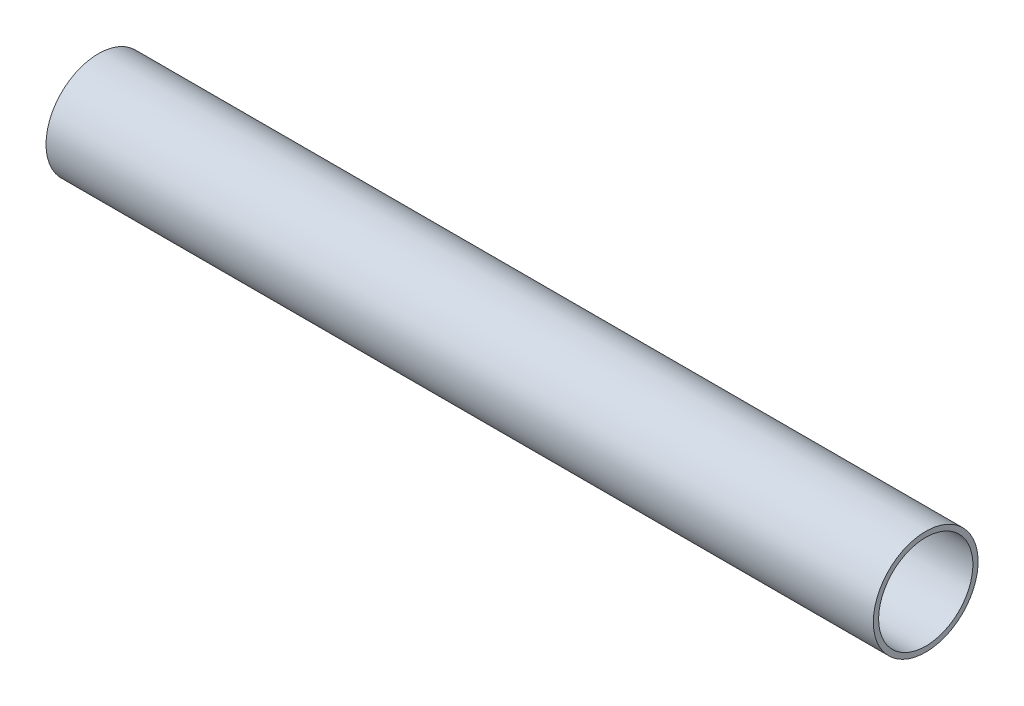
ISO-10303-21;
HEADER;
FILE_DESCRIPTION(('STEP AP214'),'2;1');
FILE_NAME('part.step','',(''),(''),'','','');
FILE_SCHEMA(('AUTOMOTIVE_DESIGN { 1 0 10303 214 1 1 1 1 }'));
ENDSEC;
DATA;
#1=APPLICATION_CONTEXT('core data for automotive mechanical design processes');
#2=APPLICATION_PROTOCOL_DEFINITION('international standard','automotive_design',2000,#1);
#3=PRODUCT_CONTEXT('',#1,'mechanical');
#4=PRODUCT('Part','Part','',(#3));
#5=PRODUCT_RELATED_PRODUCT_CATEGORY('part','',(#4));
#6=PRODUCT_DEFINITION_FORMATION('','',#4);
#7=PRODUCT_DEFINITION_CONTEXT('part definition',#1,'design');
#8=PRODUCT_DEFINITION('design','',#6,#7);
#9=PRODUCT_DEFINITION_SHAPE('','',#8);
#10=(LENGTH_UNIT() NAMED_UNIT(*) SI_UNIT(.MILLI.,.METRE.));
#11=(NAMED_UNIT(*) PLANE_ANGLE_UNIT() SI_UNIT($,.RADIAN.));
#12=(NAMED_UNIT(*) SI_UNIT($,.STERADIAN.) SOLID_ANGLE_UNIT());
#13=UNCERTAINTY_MEASURE_WITH_UNIT(LENGTH_MEASURE(1.E-05),#10,'distance_accuracy_value','');
#14=(GEOMETRIC_REPRESENTATION_CONTEXT(3) GLOBAL_UNCERTAINTY_ASSIGNED_CONTEXT((#13)) GLOBAL_UNIT_ASSIGNED_CONTEXT((#10,
#11,#12)) REPRESENTATION_CONTEXT('',''));
#15=CARTESIAN_POINT('',(0.,0.,0.));
#16=DIRECTION('',(0.,0.,1.));
#17=DIRECTION('',(1.,0.,0.));
#18=AXIS2_PLACEMENT_3D('',#15,#16,#17);
#19=CARTESIAN_POINT('',(0.,90.,0.));
#20=DIRECTION('',(1.,0.,0.));
#21=DIRECTION('',(0.,0.,-1.));
#22=AXIS2_PLACEMENT_3D('',#19,#20,#21);
#23=PLANE('',#22);
#24=CARTESIAN_POINT('',(0.,0.,0.));
#25=DIRECTION('',(-1.,0.,0.));
#26=DIRECTION('',(0.,0.,1.));
#27=AXIS2_PLACEMENT_3D('',#24,#25,#26);
#28=CIRCLE('',#27,90.);
#29=CARTESIAN_POINT('',(0.,0.,90.));
#30=VERTEX_POINT('',#29);
#31=EDGE_CURVE('E45',#30,#30,#28,.T.);
#32=ORIENTED_EDGE('',*,*,#31,.F.);
#33=EDGE_LOOP('',(#32));
#34=FACE_BOUND('',#33,.T.);
#35=CARTESIAN_POINT('',(0.,0.,0.));
#36=DIRECTION('',(-1.,0.,0.));
#37=DIRECTION('',(0.,0.,1.));
#38=AXIS2_PLACEMENT_3D('',#35,#36,#37);
#39=CIRCLE('',#38,100.);
#40=CARTESIAN_POINT('',(0.,0.,100.));
#41=VERTEX_POINT('',#40);
#42=EDGE_CURVE('E10',#41,#41,#39,.T.);
#43=ORIENTED_EDGE('',*,*,#42,.T.);
#44=EDGE_LOOP('',(#43));
#45=FACE_BOUND('',#44,.T.);
#46=ADVANCED_FACE('F31',(#34,#45),#23,.F.);
#47=CARTESIAN_POINT('',(0.,0.,0.));
#48=DIRECTION('',(-1.,0.,0.));
#49=DIRECTION('',(0.,0.,1.));
#50=AXIS2_PLACEMENT_3D('',#47,#48,#49);
#51=CYLINDRICAL_SURFACE('',#50,100.);
#52=ORIENTED_EDGE('',*,*,#42,.F.);
#53=EDGE_LOOP('',(#52));
#54=FACE_BOUND('',#53,.T.);
#55=CARTESIAN_POINT('',(1580.,0.,0.));
#56=DIRECTION('',(-1.,0.,0.));
#57=DIRECTION('',(0.,0.,1.));
#58=AXIS2_PLACEMENT_3D('',#55,#56,#57);
#59=CIRCLE('',#58,100.);
#60=CARTESIAN_POINT('',(1580.,0.,100.));
#61=VERTEX_POINT('',#60);
#62=EDGE_CURVE('E37',#61,#61,#59,.T.);
#63=ORIENTED_EDGE('',*,*,#62,.T.);
#64=EDGE_LOOP('',(#63));
#65=FACE_BOUND('',#64,.T.);
#66=ADVANCED_FACE('F54',(#54,#65),#51,.T.);
#67=CARTESIAN_POINT('',(1580.,90.,0.));
#68=DIRECTION('',(-1.,0.,0.));
#69=DIRECTION('',(0.,0.,1.));
#70=AXIS2_PLACEMENT_3D('',#67,#68,#69);
#71=PLANE('',#70);
#72=ORIENTED_EDGE('',*,*,#62,.F.);
#73=EDGE_LOOP('',(#72));
#74=FACE_BOUND('',#73,.T.);
#75=CARTESIAN_POINT('',(1580.,0.,0.));
#76=DIRECTION('',(-1.,0.,0.));
#77=DIRECTION('',(0.,0.,1.));
#78=AXIS2_PLACEMENT_3D('',#75,#76,#77);
#79=CIRCLE('',#78,90.);
#80=CARTESIAN_POINT('',(1580.,0.,90.));
#81=VERTEX_POINT('',#80);
#82=EDGE_CURVE('E41',#81,#81,#79,.T.);
#83=ORIENTED_EDGE('',*,*,#82,.T.);
#84=EDGE_LOOP('',(#83));
#85=FACE_BOUND('',#84,.T.);
#86=ADVANCED_FACE('F58',(#74,#85),#71,.F.);
#87=CARTESIAN_POINT('',(0.,0.,0.));
#88=DIRECTION('',(-1.,0.,0.));
#89=DIRECTION('',(0.,0.,1.));
#90=AXIS2_PLACEMENT_3D('',#87,#88,#89);
#91=CYLINDRICAL_SURFACE('',#90,90.);
#92=ORIENTED_EDGE('',*,*,#82,.F.);
#93=EDGE_LOOP('',(#92));
#94=FACE_BOUND('',#93,.T.);
#95=ORIENTED_EDGE('',*,*,#31,.T.);
#96=EDGE_LOOP('',(#95));
#97=FACE_BOUND('',#96,.T.);
#98=ADVANCED_FACE('F51',(#94,#97),#91,.F.);
#99=CLOSED_SHELL('',(#46,#66,#86,#98));
#100=MANIFOLD_SOLID_BREP('B2',#99);
#101=ADVANCED_BREP_SHAPE_REPRESENTATION('',(#18,#100),#14);
#102=SHAPE_DEFINITION_REPRESENTATION(#9,#101);
ENDSEC;
END-ISO-10303-21;
